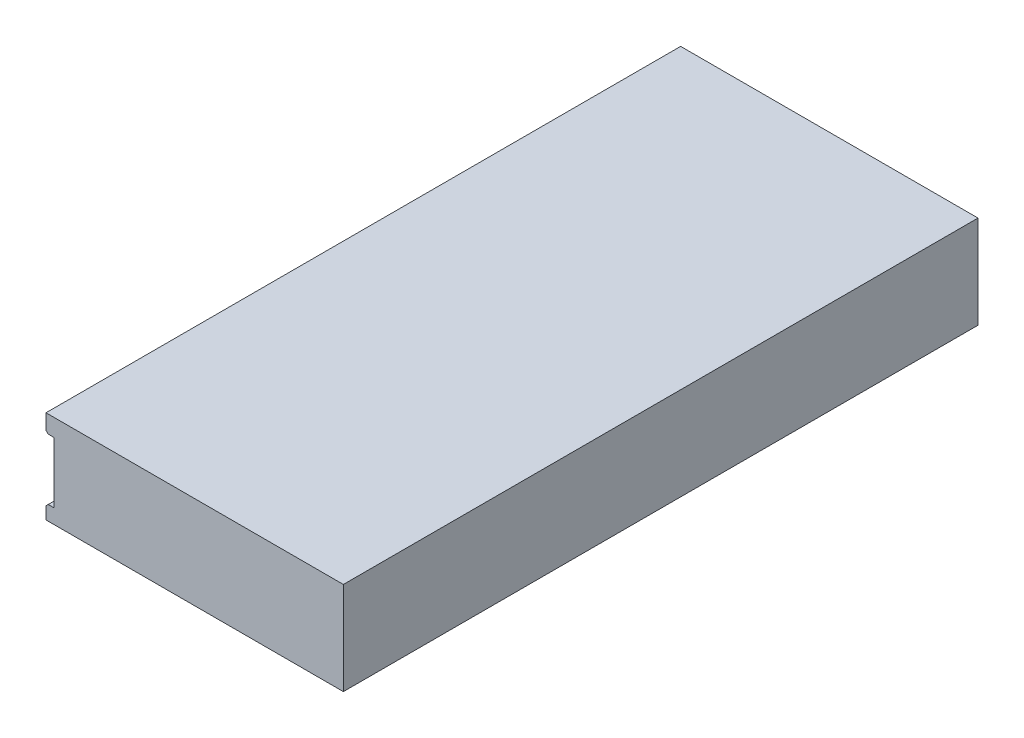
from build123d import *

# Parameters (mm, degrees)
EXTRUDE1_DEPTH                   = 55.5625
F_10_32_TAPPED_HOLE1_D           = 4.0386
F_10_32_TAPPED_HOLE1_DEPTH       = 9.99744
F_10_32_TAPPED_HOLE1_CBORE_D     = 4.826
F_10_32_TAPPED_HOLE1_CBORE_DEPTH = 7.62
F_10_32_TAPPED_HOLE1_TIP         = 1.213317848
CHAMFER1_SIZE                    = 0.381


with BuildPart() as part:
    # Sketch1 → Extrude1 (new, symmetric)
    with BuildSketch(Plane.XY):
        Polygon((50.673, 0), (50.673, -16.256), (-1.397, -16.256), (-1.397, -13.716), (0, -13.716), (0, -3.048), (-1.397, -3.048), (-1.397, 0), align=None)
    extrude(amount=EXTRUDE1_DEPTH, both=True)

    # 10-32 Tapped Hole1
    with Locations(Plane(origin=(0, -8.128, -50.2666), x_dir=(0, 0, -1), z_dir=(-1, 0, 0))):
        with Locations((0, 0), (-100.5332, 0), (-55.1434, 0), (-45.3898, 0)):
            CounterBoreHole(F_10_32_TAPPED_HOLE1_D / 2, F_10_32_TAPPED_HOLE1_CBORE_D / 2, F_10_32_TAPPED_HOLE1_CBORE_DEPTH, depth=F_10_32_TAPPED_HOLE1_DEPTH)
            with Locations((0, 0, -(F_10_32_TAPPED_HOLE1_DEPTH + F_10_32_TAPPED_HOLE1_TIP / 2))):  # 118° drill point
                Cone(0, F_10_32_TAPPED_HOLE1_D / 2, F_10_32_TAPPED_HOLE1_TIP, mode=Mode.SUBTRACT)

    # Chamfer1
    chamfer1_edges = [part.edges().sort_by_distance(p)[0] for p in [
        (-1.397, -13.716, 0),
        (-1.397, -3.048, 0),
    ]]
    chamfer(chamfer1_edges, length=CHAMFER1_SIZE)


solid = part.part
